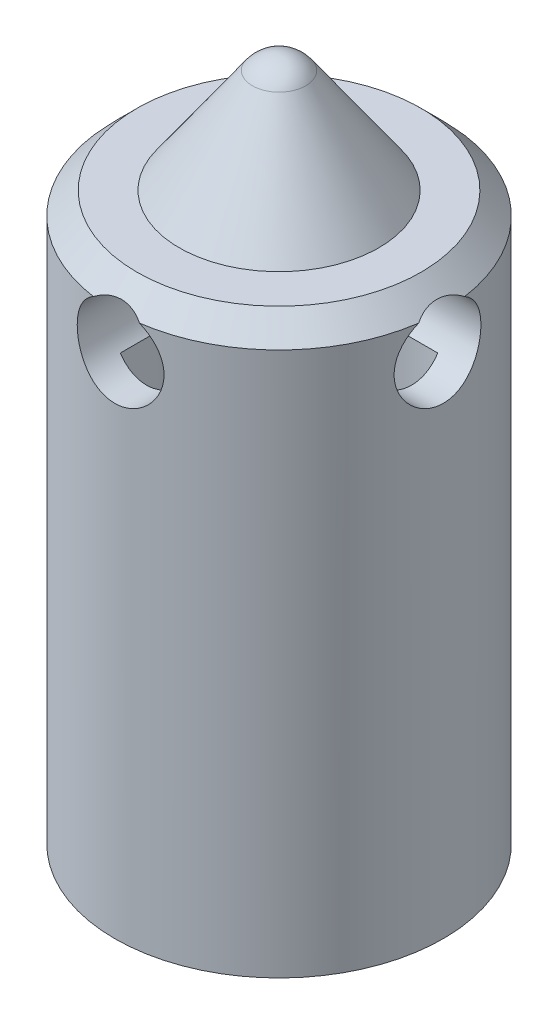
from build123d import *

# Parameters (mm, degrees)
SKETCH3_W           = 2.4257
SKETCH3_H           = 8.6868
SKETCH4_R           = 0.79375
CUT_EXTRUDE10_DEPTH = 5
SKETCH6_R           = 0.79375
CUT_EXTRUDE11_DEPTH = 5


with BuildPart() as part:
    # Sketch1 → Revolve1 (revolve)
    with BuildSketch(Plane.XY, mode=Mode.PRIVATE) as revolve1_sk:
        with BuildLine():
            Line((0, 0), (3.00355, 0))
            Line((3.00355, 0), (3.00355, 9.9441))
            Line((3.00355, 9.9441), (2.59715, 10.3505))
            Line((2.59715, 10.3505), (1.824703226, 10.3505))
            Line((1.824703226, 10.3505), (0.487980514, 12.248442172))
            ThreePointArc((0.487980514, 12.248442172), (0.274874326, 12.434557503), (0, 12.501619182))
            Line((0, 12.501619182), (0, 0))
        make_face()
    revolve(revolve1_sk.sketch.rotate(Axis((0, 13.603049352, 0), (0, -1, 0)), 90), axis=Axis((0, 13.603049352, 0), (0, -1, 0)))

    # Sketch3 → Cut-Revolve1 (revolve, cut)
    with BuildSketch(Plane.XY):
        with Locations((1.21285, 4.3434)):
            Rectangle(SKETCH3_W, SKETCH3_H)
    revolve(axis=Axis((0, 9.9441, 0), (0, -1, 0)), mode=Mode.SUBTRACT)

    # Sketch4 → Cut-Extrude10 (cut, symmetric)
    with BuildSketch(Plane.XY):
        with Locations(Location((0, 9.271, 0), (0, 0, 57.994800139))):
            Circle(SKETCH4_R)
    extrude(amount=CUT_EXTRUDE10_DEPTH, both=True, mode=Mode.SUBTRACT)

    # Sketch6 → Cut-Extrude11 (cut, symmetric)
    with BuildSketch(Plane(origin=(0, 0, 0), x_dir=(0, 0, -1), z_dir=(1, 0, 0))):
        with Locations(Location((0, 9.271, 0), (0, 0, 312.60821753))):
            Circle(SKETCH6_R)
    extrude(amount=CUT_EXTRUDE11_DEPTH, both=True, mode=Mode.SUBTRACT)


solid = part.part
